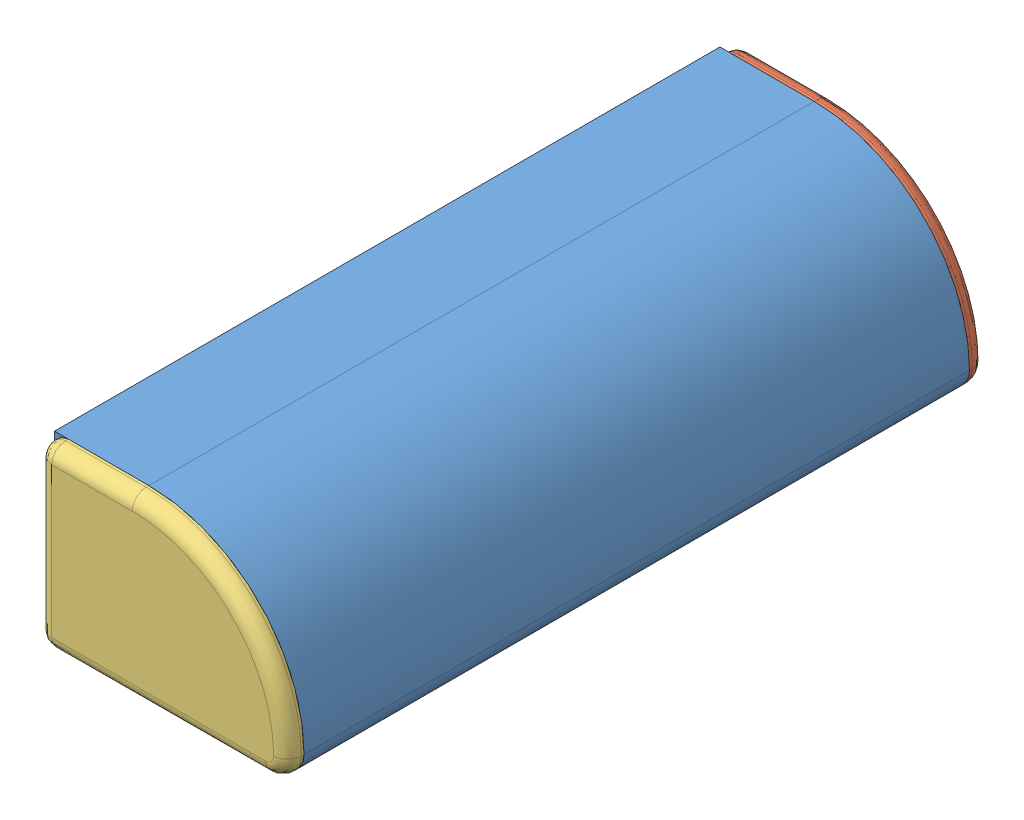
SolidWorks assembly 21.1048 CLOSED PROTECTIVE HANDLE.SLDASM, configuration Default (file format 3800). Lengths in mm.
Overall size (45 32 126).
3 component instances, 3 part files, 6 mates.
Components (placement in the parent):
- 21.1048 CLOSED PROTECTIVE HANDLE PROFILE-1: 21.1048 CLOSED PROTECTIVE HANDLE PROFILE.SLDPRT [Default] at origin size (45 32 120)
- 22.1054 END CAP FOR HANDLE PROFILE RIGHT GRAY-1: 22.1054 END CAP FOR HANDLE PROFILE RIGHT GRAY.SLDPRT [Default] at (-22.5 -9.5 -60) x (1 0 0) z (0 1 0) size (45 8 32)
- 22.1055 END CAP FOR HANDLE PROFILE LEFT GRAY-1: 22.1055 END CAP FOR HANDLE PROFILE LEFT GRAY.SLDPRT [Default] at (-22.5 -9.5 60) x (1 0 0) z (0 1 0) size (45 8 32)
Mates (geometry in assembly coordinates):
- Coincident1: coincident: plane of 21.1048 CLOSED PROTECTIVE HANDLE PROFILE-1 through (-5.5 -5.5 60) normal (0 0 1); plane of 22.1055 END CAP FOR HANDLE PROFILE LEFT GRAY-1 through (-20 -9.5 60) normal (0 0 -1)
- Coincident2: coincident: plane of 21.1048 CLOSED PROTECTIVE HANDLE PROFILE-1 through (-5.5 22.5 -60) normal (0 1 0); plane of 22.1055 END CAP FOR HANDLE PROFILE LEFT GRAY-1 through (-5.5 22.5 63) normal (0 1 0)
- Coincident3: coincident aligned: plane of 21.1048 CLOSED PROTECTIVE HANDLE PROFILE-1 through (-22.5 22.5 -60) normal (-1 0 0); plane of 22.1055 END CAP FOR HANDLE PROFILE LEFT GRAY-1 through (-22.5 20 63) normal (-1 0 0)
- Coincident4: coincident: plane of 21.1048 CLOSED PROTECTIVE HANDLE PROFILE-1 through (-5.5 -5.5 -60) normal (0 0 -1); plane of ? through (-49.0889 22.5 -60) normal (0 0 1)
- Coincident5: coincident: plane of 21.1048 CLOSED PROTECTIVE HANDLE PROFILE-1 through (-5.5 22.5 -60) normal (0 1 0); plane of ? through (-91.5889 22.5 -60.5) normal (0 1 0)
- Coincident6: coincident aligned: plane of 21.1048 CLOSED PROTECTIVE HANDLE PROFILE-1 through (-22.5 22.5 -60) normal (-1 0 0); plane of ? through (-94.0889 20 -60) normal (-1 0 0)
